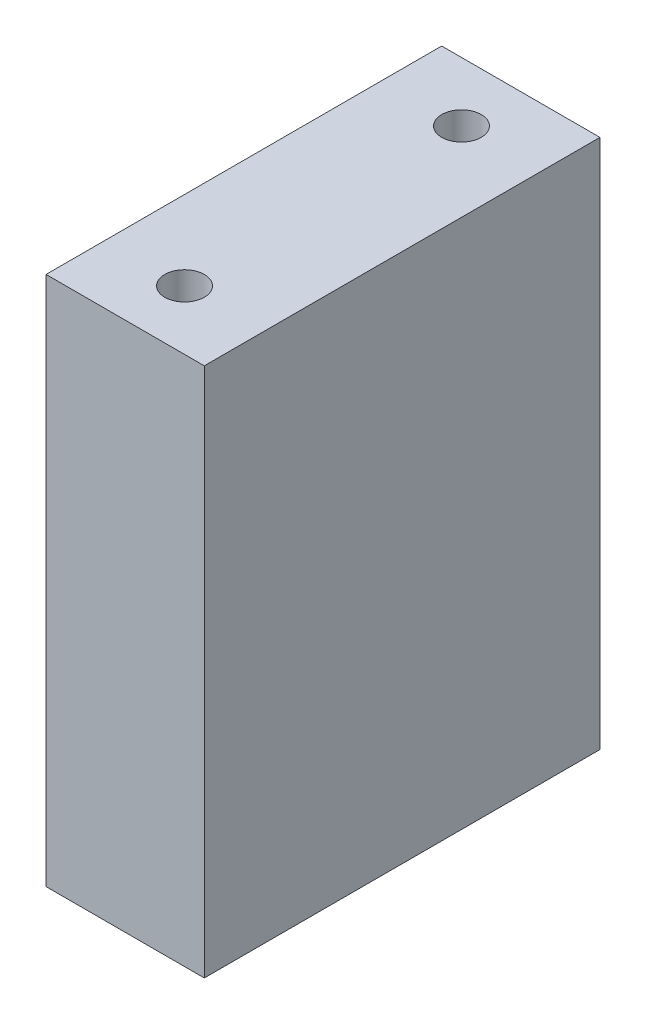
ISO-10303-21;
HEADER;
FILE_DESCRIPTION(('STEP AP214'),'2;1');
FILE_NAME('part.step','',(''),(''),'','','');
FILE_SCHEMA(('AUTOMOTIVE_DESIGN { 1 0 10303 214 1 1 1 1 }'));
ENDSEC;
DATA;
#1=APPLICATION_CONTEXT('core data for automotive mechanical design processes');
#2=APPLICATION_PROTOCOL_DEFINITION('international standard','automotive_design',2000,#1);
#3=PRODUCT_CONTEXT('',#1,'mechanical');
#4=PRODUCT('Part','Part','',(#3));
#5=PRODUCT_RELATED_PRODUCT_CATEGORY('part','',(#4));
#6=PRODUCT_DEFINITION_FORMATION('','',#4);
#7=PRODUCT_DEFINITION_CONTEXT('part definition',#1,'design');
#8=PRODUCT_DEFINITION('design','',#6,#7);
#9=PRODUCT_DEFINITION_SHAPE('','',#8);
#10=(LENGTH_UNIT() NAMED_UNIT(*) SI_UNIT(.MILLI.,.METRE.));
#11=(NAMED_UNIT(*) PLANE_ANGLE_UNIT() SI_UNIT($,.RADIAN.));
#12=(NAMED_UNIT(*) SI_UNIT($,.STERADIAN.) SOLID_ANGLE_UNIT());
#13=UNCERTAINTY_MEASURE_WITH_UNIT(LENGTH_MEASURE(1.E-05),#10,'distance_accuracy_value','');
#14=(GEOMETRIC_REPRESENTATION_CONTEXT(3) GLOBAL_UNCERTAINTY_ASSIGNED_CONTEXT((#13)) GLOBAL_UNIT_ASSIGNED_CONTEXT((#10,
#11,#12)) REPRESENTATION_CONTEXT('',''));
#15=CARTESIAN_POINT('',(0.,0.,0.));
#16=DIRECTION('',(0.,0.,1.));
#17=DIRECTION('',(1.,0.,0.));
#18=AXIS2_PLACEMENT_3D('',#15,#16,#17);
#19=CARTESIAN_POINT('',(0.,51.9999999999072,-17.5));
#20=DIRECTION('',(0.,1.,0.));
#21=DIRECTION('',(0.,0.,1.));
#22=AXIS2_PLACEMENT_3D('',#19,#20,#21);
#23=CONICAL_SURFACE('',#22,2.49999999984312,1.02974425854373);
#24=CARTESIAN_POINT('',(0.,50.4978484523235,-17.5));
#25=VERTEX_POINT('',#24);
#26=VERTEX_LOOP('',#25);
#27=FACE_BOUND('',#26,.T.);
#28=CARTESIAN_POINT('',(0.,52.,-17.5));
#29=DIRECTION('',(0.,1.,0.));
#30=DIRECTION('',(0.,0.,1.));
#31=AXIS2_PLACEMENT_3D('',#28,#29,#30);
#32=CIRCLE('',#31,2.5);
#33=CARTESIAN_POINT('',(0.,52.,-15.));
#34=VERTEX_POINT('',#33);
#35=EDGE_CURVE('E72',#34,#34,#32,.T.);
#36=ORIENTED_EDGE('',*,*,#35,.T.);
#37=EDGE_LOOP('',(#36));
#38=FACE_BOUND('',#37,.T.);
#39=ADVANCED_FACE('F17',(#27,#38),#23,.F.);
#40=CARTESIAN_POINT('',(0.,51.9999999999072,17.5));
#41=DIRECTION('',(0.,1.,0.));
#42=DIRECTION('',(0.,0.,1.));
#43=AXIS2_PLACEMENT_3D('',#40,#41,#42);
#44=CONICAL_SURFACE('',#43,2.49999999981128,1.02974425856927);
#45=CARTESIAN_POINT('',(0.,50.4978484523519,17.5000000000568));
#46=VERTEX_POINT('',#45);
#47=VERTEX_LOOP('',#46);
#48=FACE_BOUND('',#47,.T.);
#49=CARTESIAN_POINT('',(0.,52.,17.5));
#50=DIRECTION('',(0.,1.,0.));
#51=DIRECTION('',(0.,0.,1.));
#52=AXIS2_PLACEMENT_3D('',#49,#50,#51);
#53=CIRCLE('',#52,2.5);
#54=CARTESIAN_POINT('',(0.,52.,20.));
#55=VERTEX_POINT('',#54);
#56=EDGE_CURVE('E74',#55,#55,#53,.T.);
#57=ORIENTED_EDGE('',*,*,#56,.T.);
#58=EDGE_LOOP('',(#57));
#59=FACE_BOUND('',#58,.T.);
#60=ADVANCED_FACE('F69',(#48,#59),#44,.F.);
#61=CARTESIAN_POINT('',(0.,15.0000000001,-17.5));
#62=DIRECTION('',(0.,-1.,0.));
#63=DIRECTION('',(1.,0.,0.));
#64=AXIS2_PLACEMENT_3D('',#61,#62,#63);
#65=CONICAL_SURFACE('',#64,2.49999999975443,1.02974425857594);
#66=CARTESIAN_POINT('',(0.,16.5021515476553,-17.4999999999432));
#67=VERTEX_POINT('',#66);
#68=VERTEX_LOOP('',#67);
#69=FACE_BOUND('',#68,.T.);
#70=CARTESIAN_POINT('',(0.,15.,-17.5));
#71=DIRECTION('',(0.,-1.,0.));
#72=DIRECTION('',(0.,0.,-1.));
#73=AXIS2_PLACEMENT_3D('',#70,#71,#72);
#74=CIRCLE('',#73,2.5);
#75=CARTESIAN_POINT('',(0.,15.,-20.));
#76=VERTEX_POINT('',#75);
#77=EDGE_CURVE('E77',#76,#76,#74,.T.);
#78=ORIENTED_EDGE('',*,*,#77,.T.);
#79=EDGE_LOOP('',(#78));
#80=FACE_BOUND('',#79,.T.);
#81=ADVANCED_FACE('F110',(#69,#80),#65,.F.);
#82=CARTESIAN_POINT('',(0.,14.9999999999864,17.5));
#83=DIRECTION('',(0.,-1.,0.));
#84=DIRECTION('',(0.,0.,-1.));
#85=AXIS2_PLACEMENT_3D('',#82,#83,#84);
#86=CONICAL_SURFACE('',#85,2.4999999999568,1.02974425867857);
#87=CARTESIAN_POINT('',(0.,16.5021515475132,17.5));
#88=VERTEX_POINT('',#87);
#89=VERTEX_LOOP('',#88);
#90=FACE_BOUND('',#89,.T.);
#91=CARTESIAN_POINT('',(0.,15.,17.5));
#92=DIRECTION('',(0.,-1.,0.));
#93=DIRECTION('',(0.,0.,-1.));
#94=AXIS2_PLACEMENT_3D('',#91,#92,#93);
#95=CIRCLE('',#94,2.5);
#96=CARTESIAN_POINT('',(0.,15.,15.));
#97=VERTEX_POINT('',#96);
#98=EDGE_CURVE('E99',#97,#97,#95,.T.);
#99=ORIENTED_EDGE('',*,*,#98,.T.);
#100=EDGE_LOOP('',(#99));
#101=FACE_BOUND('',#100,.T.);
#102=ADVANCED_FACE('F157',(#90,#101),#86,.F.);
#103=CARTESIAN_POINT('',(0.,67.,-17.5));
#104=DIRECTION('',(0.,1.,0.));
#105=DIRECTION('',(0.,0.,1.));
#106=AXIS2_PLACEMENT_3D('',#103,#104,#105);
#107=CYLINDRICAL_SURFACE('',#106,2.5);
#108=CARTESIAN_POINT('',(0.,67.,-17.5));
#109=DIRECTION('',(0.,1.,0.));
#110=DIRECTION('',(0.,0.,1.));
#111=AXIS2_PLACEMENT_3D('',#108,#109,#110);
#112=CIRCLE('',#111,2.5);
#113=CARTESIAN_POINT('',(0.,67.,-15.));
#114=VERTEX_POINT('',#113);
#115=EDGE_CURVE('E20',#114,#114,#112,.F.);
#116=ORIENTED_EDGE('',*,*,#115,.F.);
#117=EDGE_LOOP('',(#116));
#118=FACE_BOUND('',#117,.T.);
#119=ORIENTED_EDGE('',*,*,#35,.F.);
#120=EDGE_LOOP('',(#119));
#121=FACE_BOUND('',#120,.T.);
#122=ADVANCED_FACE('F153',(#118,#121),#107,.F.);
#123=CARTESIAN_POINT('',(0.,67.,17.5));
#124=DIRECTION('',(0.,1.,0.));
#125=DIRECTION('',(0.,0.,1.));
#126=AXIS2_PLACEMENT_3D('',#123,#124,#125);
#127=CYLINDRICAL_SURFACE('',#126,2.5);
#128=CARTESIAN_POINT('',(0.,67.,17.5));
#129=DIRECTION('',(0.,1.,0.));
#130=DIRECTION('',(0.,0.,1.));
#131=AXIS2_PLACEMENT_3D('',#128,#129,#130);
#132=CIRCLE('',#131,2.5);
#133=CARTESIAN_POINT('',(0.,67.,20.));
#134=VERTEX_POINT('',#133);
#135=EDGE_CURVE('E87',#134,#134,#132,.F.);
#136=ORIENTED_EDGE('',*,*,#135,.F.);
#137=EDGE_LOOP('',(#136));
#138=FACE_BOUND('',#137,.T.);
#139=ORIENTED_EDGE('',*,*,#56,.F.);
#140=EDGE_LOOP('',(#139));
#141=FACE_BOUND('',#140,.T.);
#142=ADVANCED_FACE('F116',(#138,#141),#127,.F.);
#143=CARTESIAN_POINT('',(0.,0.,-17.5));
#144=DIRECTION('',(0.,-1.,0.));
#145=DIRECTION('',(0.,0.,-1.));
#146=AXIS2_PLACEMENT_3D('',#143,#144,#145);
#147=CYLINDRICAL_SURFACE('',#146,2.5);
#148=ORIENTED_EDGE('',*,*,#77,.F.);
#149=EDGE_LOOP('',(#148));
#150=FACE_BOUND('',#149,.T.);
#151=CARTESIAN_POINT('',(0.,0.,-17.5));
#152=DIRECTION('',(0.,-1.,0.));
#153=DIRECTION('',(0.,0.,-1.));
#154=AXIS2_PLACEMENT_3D('',#151,#152,#153);
#155=CIRCLE('',#154,2.5);
#156=CARTESIAN_POINT('',(0.,0.,-20.));
#157=VERTEX_POINT('',#156);
#158=EDGE_CURVE('E84',#157,#157,#155,.T.);
#159=ORIENTED_EDGE('',*,*,#158,.T.);
#160=EDGE_LOOP('',(#159));
#161=FACE_BOUND('',#160,.T.);
#162=ADVANCED_FACE('F112',(#150,#161),#147,.F.);
#163=CARTESIAN_POINT('',(0.,0.,17.5));
#164=DIRECTION('',(0.,-1.,0.));
#165=DIRECTION('',(0.,0.,-1.));
#166=AXIS2_PLACEMENT_3D('',#163,#164,#165);
#167=CYLINDRICAL_SURFACE('',#166,2.5);
#168=ORIENTED_EDGE('',*,*,#98,.F.);
#169=EDGE_LOOP('',(#168));
#170=FACE_BOUND('',#169,.T.);
#171=CARTESIAN_POINT('',(0.,0.,17.5));
#172=DIRECTION('',(0.,-1.,0.));
#173=DIRECTION('',(0.,0.,-1.));
#174=AXIS2_PLACEMENT_3D('',#171,#172,#173);
#175=CIRCLE('',#174,2.5);
#176=CARTESIAN_POINT('',(0.,0.,15.));
#177=VERTEX_POINT('',#176);
#178=EDGE_CURVE('E81',#177,#177,#175,.T.);
#179=ORIENTED_EDGE('',*,*,#178,.T.);
#180=EDGE_LOOP('',(#179));
#181=FACE_BOUND('',#180,.T.);
#182=ADVANCED_FACE('F115',(#170,#181),#167,.F.);
#183=CARTESIAN_POINT('',(-10.,67.,-25.));
#184=DIRECTION('',(1.,0.,0.));
#185=DIRECTION('',(0.,0.,-1.));
#186=AXIS2_PLACEMENT_3D('',#183,#184,#185);
#187=PLANE('',#186);
#188=DIRECTION('',(0.,1.,0.));
#189=VECTOR('',#188,1.);
#190=CARTESIAN_POINT('',(-9.99999999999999,67.,25.));
#191=LINE('',#190,#189);
#192=CARTESIAN_POINT('',(-10.,0.,25.));
#193=VERTEX_POINT('',#192);
#194=CARTESIAN_POINT('',(-10.,67.,25.));
#195=VERTEX_POINT('',#194);
#196=EDGE_CURVE('E95',#193,#195,#191,.T.);
#197=ORIENTED_EDGE('',*,*,#196,.T.);
#198=DIRECTION('',(0.,0.,1.));
#199=VECTOR('',#198,1.);
#200=CARTESIAN_POINT('',(-10.,67.,0.));
#201=LINE('',#200,#199);
#202=CARTESIAN_POINT('',(-10.,67.,-25.));
#203=VERTEX_POINT('',#202);
#204=EDGE_CURVE('E89',#203,#195,#201,.T.);
#205=ORIENTED_EDGE('',*,*,#204,.F.);
#206=DIRECTION('',(0.,1.,0.));
#207=VECTOR('',#206,1.);
#208=CARTESIAN_POINT('',(-10.,67.,-25.));
#209=LINE('',#208,#207);
#210=CARTESIAN_POINT('',(-10.,0.,-25.));
#211=VERTEX_POINT('',#210);
#212=EDGE_CURVE('E86',#203,#211,#209,.F.);
#213=ORIENTED_EDGE('',*,*,#212,.T.);
#214=DIRECTION('',(0.,0.,1.));
#215=VECTOR('',#214,1.);
#216=CARTESIAN_POINT('',(-10.,0.,0.));
#217=LINE('',#216,#215);
#218=EDGE_CURVE('E305',#211,#193,#217,.T.);
#219=ORIENTED_EDGE('',*,*,#218,.T.);
#220=EDGE_LOOP('',(#197,#205,#213,#219));
#221=FACE_BOUND('',#220,.T.);
#222=ADVANCED_FACE('F144',(#221),#187,.F.);
#223=CARTESIAN_POINT('',(-9.99999999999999,67.,25.));
#224=DIRECTION('',(0.,0.,-1.));
#225=DIRECTION('',(-1.,0.,0.));
#226=AXIS2_PLACEMENT_3D('',#223,#224,#225);
#227=PLANE('',#226);
#228=DIRECTION('',(0.,1.,0.));
#229=VECTOR('',#228,1.);
#230=CARTESIAN_POINT('',(10.,67.,25.));
#231=LINE('',#230,#229);
#232=CARTESIAN_POINT('',(10.,0.,25.));
#233=VERTEX_POINT('',#232);
#234=CARTESIAN_POINT('',(10.,67.,25.));
#235=VERTEX_POINT('',#234);
#236=EDGE_CURVE('E298',#233,#235,#231,.T.);
#237=ORIENTED_EDGE('',*,*,#236,.T.);
#238=DIRECTION('',(1.,0.,0.));
#239=VECTOR('',#238,1.);
#240=CARTESIAN_POINT('',(0.,67.,25.));
#241=LINE('',#240,#239);
#242=EDGE_CURVE('E92',#195,#235,#241,.T.);
#243=ORIENTED_EDGE('',*,*,#242,.F.);
#244=ORIENTED_EDGE('',*,*,#196,.F.);
#245=DIRECTION('',(1.,0.,0.));
#246=VECTOR('',#245,1.);
#247=CARTESIAN_POINT('',(0.,0.,25.));
#248=LINE('',#247,#246);
#249=EDGE_CURVE('E299',#193,#233,#248,.T.);
#250=ORIENTED_EDGE('',*,*,#249,.T.);
#251=EDGE_LOOP('',(#237,#243,#244,#250));
#252=FACE_BOUND('',#251,.T.);
#253=ADVANCED_FACE('F140',(#252),#227,.F.);
#254=CARTESIAN_POINT('',(0.,67.,0.));
#255=DIRECTION('',(0.,1.,0.));
#256=DIRECTION('',(0.,0.,1.));
#257=AXIS2_PLACEMENT_3D('',#254,#255,#256);
#258=PLANE('',#257);
#259=ORIENTED_EDGE('',*,*,#204,.T.);
#260=ORIENTED_EDGE('',*,*,#242,.T.);
#261=DIRECTION('',(0.,0.,1.));
#262=VECTOR('',#261,1.);
#263=CARTESIAN_POINT('',(10.,67.,-25.));
#264=LINE('',#263,#262);
#265=CARTESIAN_POINT('',(10.,67.,-25.));
#266=VERTEX_POINT('',#265);
#267=EDGE_CURVE('E301',#235,#266,#264,.F.);
#268=ORIENTED_EDGE('',*,*,#267,.T.);
#269=DIRECTION('',(1.,0.,0.));
#270=VECTOR('',#269,1.);
#271=CARTESIAN_POINT('',(-10.,67.,-25.));
#272=LINE('',#271,#270);
#273=EDGE_CURVE('E312',#266,#203,#272,.F.);
#274=ORIENTED_EDGE('',*,*,#273,.T.);
#275=EDGE_LOOP('',(#259,#260,#268,#274));
#276=FACE_BOUND('',#275,.T.);
#277=ORIENTED_EDGE('',*,*,#135,.T.);
#278=EDGE_LOOP('',(#277));
#279=FACE_BOUND('',#278,.T.);
#280=ORIENTED_EDGE('',*,*,#115,.T.);
#281=EDGE_LOOP('',(#280));
#282=FACE_BOUND('',#281,.T.);
#283=ADVANCED_FACE('F132',(#276,#279,#282),#258,.T.);
#284=CARTESIAN_POINT('',(-10.,67.,-25.));
#285=DIRECTION('',(0.,0.,1.));
#286=DIRECTION('',(1.,0.,0.));
#287=AXIS2_PLACEMENT_3D('',#284,#285,#286);
#288=PLANE('',#287);
#289=ORIENTED_EDGE('',*,*,#212,.F.);
#290=ORIENTED_EDGE('',*,*,#273,.F.);
#291=DIRECTION('',(0.,1.,0.));
#292=VECTOR('',#291,1.);
#293=CARTESIAN_POINT('',(10.,67.,-25.));
#294=LINE('',#293,#292);
#295=CARTESIAN_POINT('',(10.,0.,-25.));
#296=VERTEX_POINT('',#295);
#297=EDGE_CURVE('E26',#266,#296,#294,.F.);
#298=ORIENTED_EDGE('',*,*,#297,.T.);
#299=DIRECTION('',(1.,0.,0.));
#300=VECTOR('',#299,1.);
#301=CARTESIAN_POINT('',(0.,0.,-25.));
#302=LINE('',#301,#300);
#303=EDGE_CURVE('E34',#296,#211,#302,.F.);
#304=ORIENTED_EDGE('',*,*,#303,.T.);
#305=EDGE_LOOP('',(#289,#290,#298,#304));
#306=FACE_BOUND('',#305,.T.);
#307=ADVANCED_FACE('F123',(#306),#288,.F.);
#308=CARTESIAN_POINT('',(0.,0.,0.));
#309=DIRECTION('',(0.,1.,0.));
#310=DIRECTION('',(0.,0.,1.));
#311=AXIS2_PLACEMENT_3D('',#308,#309,#310);
#312=PLANE('',#311);
#313=ORIENTED_EDGE('',*,*,#249,.F.);
#314=ORIENTED_EDGE('',*,*,#218,.F.);
#315=ORIENTED_EDGE('',*,*,#303,.F.);
#316=DIRECTION('',(0.,0.,1.));
#317=VECTOR('',#316,1.);
#318=CARTESIAN_POINT('',(10.,0.,-25.));
#319=LINE('',#318,#317);
#320=EDGE_CURVE('E11',#296,#233,#319,.T.);
#321=ORIENTED_EDGE('',*,*,#320,.T.);
#322=EDGE_LOOP('',(#313,#314,#315,#321));
#323=FACE_BOUND('',#322,.T.);
#324=ORIENTED_EDGE('',*,*,#178,.F.);
#325=EDGE_LOOP('',(#324));
#326=FACE_BOUND('',#325,.T.);
#327=ORIENTED_EDGE('',*,*,#158,.F.);
#328=EDGE_LOOP('',(#327));
#329=FACE_BOUND('',#328,.T.);
#330=ADVANCED_FACE('F120',(#323,#326,#329),#312,.F.);
#331=CARTESIAN_POINT('',(10.,67.,-25.));
#332=DIRECTION('',(-1.,0.,0.));
#333=DIRECTION('',(0.,0.,1.));
#334=AXIS2_PLACEMENT_3D('',#331,#332,#333);
#335=PLANE('',#334);
#336=ORIENTED_EDGE('',*,*,#297,.F.);
#337=ORIENTED_EDGE('',*,*,#267,.F.);
#338=ORIENTED_EDGE('',*,*,#236,.F.);
#339=ORIENTED_EDGE('',*,*,#320,.F.);
#340=EDGE_LOOP('',(#336,#337,#338,#339));
#341=FACE_BOUND('',#340,.T.);
#342=ADVANCED_FACE('F122',(#341),#335,.F.);
#343=CLOSED_SHELL('',(#39,#60,#81,#102,#122,#142,#162,#182,#222,#253,#283,#307,#330,#342));
#344=MANIFOLD_SOLID_BREP('B1',#343);
#345=ADVANCED_BREP_SHAPE_REPRESENTATION('',(#18,#344),#14);
#346=SHAPE_DEFINITION_REPRESENTATION(#9,#345);
ENDSEC;
END-ISO-10303-21;
